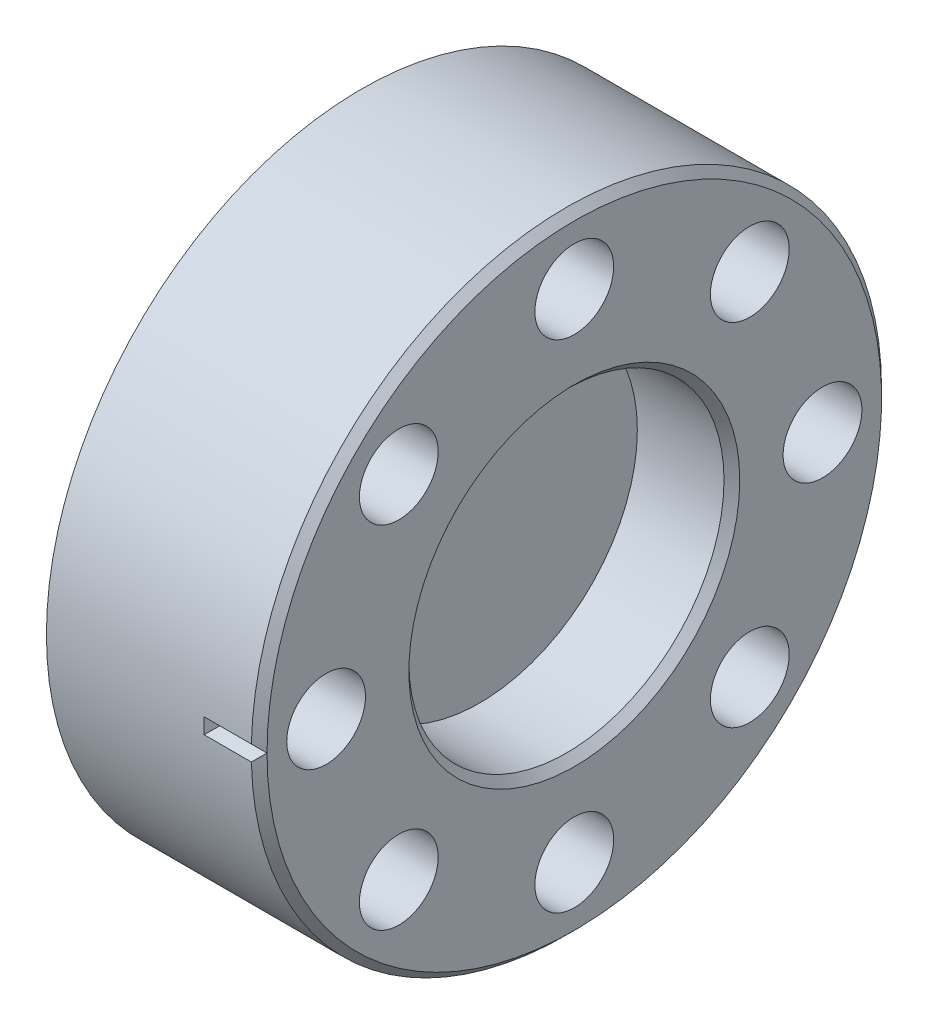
ISO-10303-21;
HEADER;
FILE_DESCRIPTION(('STEP AP214'),'2;1');
FILE_NAME('part.step','',(''),(''),'','','');
FILE_SCHEMA(('AUTOMOTIVE_DESIGN { 1 0 10303 214 1 1 1 1 }'));
ENDSEC;
DATA;
#1=APPLICATION_CONTEXT('core data for automotive mechanical design processes');
#2=APPLICATION_PROTOCOL_DEFINITION('international standard','automotive_design',2000,#1);
#3=PRODUCT_CONTEXT('',#1,'mechanical');
#4=PRODUCT('Part','Part','',(#3));
#5=PRODUCT_RELATED_PRODUCT_CATEGORY('part','',(#4));
#6=PRODUCT_DEFINITION_FORMATION('','',#4);
#7=PRODUCT_DEFINITION_CONTEXT('part definition',#1,'design');
#8=PRODUCT_DEFINITION('design','',#6,#7);
#9=PRODUCT_DEFINITION_SHAPE('','',#8);
#10=(LENGTH_UNIT() NAMED_UNIT(*) SI_UNIT(.MILLI.,.METRE.));
#11=(NAMED_UNIT(*) PLANE_ANGLE_UNIT() SI_UNIT($,.RADIAN.));
#12=(NAMED_UNIT(*) SI_UNIT($,.STERADIAN.) SOLID_ANGLE_UNIT());
#13=UNCERTAINTY_MEASURE_WITH_UNIT(LENGTH_MEASURE(1.E-05),#10,'distance_accuracy_value','');
#14=(GEOMETRIC_REPRESENTATION_CONTEXT(3) GLOBAL_UNCERTAINTY_ASSIGNED_CONTEXT((#13)) GLOBAL_UNIT_ASSIGNED_CONTEXT((#10,
#11,#12)) REPRESENTATION_CONTEXT('',''));
#15=CARTESIAN_POINT('',(0.,0.,0.));
#16=DIRECTION('',(0.,0.,1.));
#17=DIRECTION('',(1.,0.,0.));
#18=AXIS2_PLACEMENT_3D('',#15,#16,#17);
#19=CARTESIAN_POINT('',(614.,-1.9134171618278,990.380602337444));
#20=DIRECTION('',(-1.,0.,0.));
#21=DIRECTION('',(0.,0.,1.));
#22=AXIS2_PLACEMENT_3D('',#19,#20,#21);
#23=PLANE('',#22);
#24=CARTESIAN_POINT('',(614.,-2.33146835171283E-12,995.));
#25=DIRECTION('',(-1.,0.,0.));
#26=DIRECTION('',(0.,0.,1.));
#27=AXIS2_PLACEMENT_3D('',#24,#25,#26);
#28=CIRCLE('',#27,10.);
#29=CARTESIAN_POINT('',(614.,-2.33146835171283E-12,1005.));
#30=VERTEX_POINT('',#29);
#31=EDGE_CURVE('E20',#30,#30,#28,.F.);
#32=ORIENTED_EDGE('',*,*,#31,.T.);
#33=EDGE_LOOP('',(#32));
#34=FACE_BOUND('',#33,.T.);
#35=ADVANCED_FACE('F17',(#34),#23,.F.);
#36=CARTESIAN_POINT('',(612.999999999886,15.7499999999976,995.));
#37=DIRECTION('',(1.,0.,0.));
#38=DIRECTION('',(0.,0.,-1.));
#39=AXIS2_PLACEMENT_3D('',#36,#37,#38);
#40=CONICAL_SURFACE('',#39,2.4999999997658,1.02974425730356);
#41=CARTESIAN_POINT('',(611.497848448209,15.7499999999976,995.000000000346));
#42=VERTEX_POINT('',#41);
#43=VERTEX_LOOP('',#42);
#44=FACE_BOUND('',#43,.T.);
#45=CARTESIAN_POINT('',(613.,15.7499999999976,995.));
#46=DIRECTION('',(-1.,0.,0.));
#47=DIRECTION('',(0.,0.,1.));
#48=AXIS2_PLACEMENT_3D('',#45,#46,#47);
#49=CIRCLE('',#48,2.5);
#50=CARTESIAN_POINT('',(613.,15.7499999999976,997.5));
#51=VERTEX_POINT('',#50);
#52=EDGE_CURVE('E279',#51,#51,#49,.F.);
#53=ORIENTED_EDGE('',*,*,#52,.T.);
#54=EDGE_LOOP('',(#53));
#55=FACE_BOUND('',#54,.T.);
#56=ADVANCED_FACE('F171',(#44,#55),#40,.F.);
#57=CARTESIAN_POINT('',(612.999999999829,11.1369318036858,983.863068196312));
#58=DIRECTION('',(1.,0.,0.));
#59=DIRECTION('',(0.,0.,-1.));
#60=AXIS2_PLACEMENT_3D('',#57,#58,#59);
#61=CONICAL_SURFACE('',#60,2.499999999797,1.02974425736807);
#62=CARTESIAN_POINT('',(611.497848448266,11.1369318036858,983.863068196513));
#63=VERTEX_POINT('',#62);
#64=VERTEX_LOOP('',#63);
#65=FACE_BOUND('',#64,.T.);
#66=CARTESIAN_POINT('',(613.,11.1369318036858,983.863068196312));
#67=DIRECTION('',(-1.,0.,0.));
#68=DIRECTION('',(0.,0.,1.));
#69=AXIS2_PLACEMENT_3D('',#66,#67,#68);
#70=CIRCLE('',#69,2.5);
#71=CARTESIAN_POINT('',(613.,11.1369318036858,986.363068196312));
#72=VERTEX_POINT('',#71);
#73=EDGE_CURVE('E274',#72,#72,#70,.F.);
#74=ORIENTED_EDGE('',*,*,#73,.T.);
#75=EDGE_LOOP('',(#74));
#76=FACE_BOUND('',#75,.T.);
#77=ADVANCED_FACE('F168',(#65,#76),#61,.F.);
#78=CARTESIAN_POINT('',(612.999999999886,11.1369318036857,1006.13693180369));
#79=DIRECTION('',(1.,0.,0.));
#80=DIRECTION('',(0.,0.,-1.));
#81=AXIS2_PLACEMENT_3D('',#78,#79,#80);
#82=CONICAL_SURFACE('',#81,2.49999999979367,1.02974425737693);
#83=CARTESIAN_POINT('',(611.49784844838,11.1369318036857,1006.13693180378));
#84=VERTEX_POINT('',#83);
#85=VERTEX_LOOP('',#84);
#86=FACE_BOUND('',#85,.T.);
#87=CARTESIAN_POINT('',(613.,11.1369318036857,1006.13693180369));
#88=DIRECTION('',(-1.,0.,0.));
#89=DIRECTION('',(0.,0.,1.));
#90=AXIS2_PLACEMENT_3D('',#87,#88,#89);
#91=CIRCLE('',#90,2.5);
#92=CARTESIAN_POINT('',(613.,11.1369318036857,1008.63693180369));
#93=VERTEX_POINT('',#92);
#94=EDGE_CURVE('E269',#93,#93,#91,.F.);
#95=ORIENTED_EDGE('',*,*,#94,.T.);
#96=EDGE_LOOP('',(#95));
#97=FACE_BOUND('',#96,.T.);
#98=ADVANCED_FACE('F164',(#86,#97),#82,.F.);
#99=CARTESIAN_POINT('',(612.999999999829,-2.44249065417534E-12,979.25));
#100=DIRECTION('',(1.,0.,0.));
#101=DIRECTION('',(0.,0.,-1.));
#102=AXIS2_PLACEMENT_3D('',#99,#100,#101);
#103=CONICAL_SURFACE('',#102,2.49999999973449,1.02974425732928);
#104=CARTESIAN_POINT('',(611.497848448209,-2.44249065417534E-12,979.250000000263));
#105=VERTEX_POINT('',#104);
#106=VERTEX_LOOP('',#105);
#107=FACE_BOUND('',#106,.T.);
#108=CARTESIAN_POINT('',(613.,-2.44249065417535E-12,979.25));
#109=DIRECTION('',(-1.,0.,0.));
#110=DIRECTION('',(0.,0.,1.));
#111=AXIS2_PLACEMENT_3D('',#108,#109,#110);
#112=CIRCLE('',#111,2.5);
#113=CARTESIAN_POINT('',(613.,-2.44249065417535E-12,981.75));
#114=VERTEX_POINT('',#113);
#115=EDGE_CURVE('E264',#114,#114,#112,.F.);
#116=ORIENTED_EDGE('',*,*,#115,.T.);
#117=EDGE_LOOP('',(#116));
#118=FACE_BOUND('',#117,.T.);
#119=ADVANCED_FACE('F160',(#107,#118),#103,.F.);
#120=CARTESIAN_POINT('',(612.999999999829,-11.1369318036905,983.863068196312));
#121=DIRECTION('',(1.,0.,0.));
#122=DIRECTION('',(0.,0.,-1.));
#123=AXIS2_PLACEMENT_3D('',#120,#121,#122);
#124=CONICAL_SURFACE('',#123,2.499999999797,1.02974425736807);
#125=CARTESIAN_POINT('',(611.497848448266,-11.1369318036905,983.863068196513));
#126=VERTEX_POINT('',#125);
#127=VERTEX_LOOP('',#126);
#128=FACE_BOUND('',#127,.T.);
#129=CARTESIAN_POINT('',(613.,-11.1369318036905,983.863068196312));
#130=DIRECTION('',(-1.,0.,0.));
#131=DIRECTION('',(0.,0.,1.));
#132=AXIS2_PLACEMENT_3D('',#129,#130,#131);
#133=CIRCLE('',#132,2.5);
#134=CARTESIAN_POINT('',(613.,-11.1369318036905,986.363068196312));
#135=VERTEX_POINT('',#134);
#136=EDGE_CURVE('E259',#135,#135,#133,.F.);
#137=ORIENTED_EDGE('',*,*,#136,.T.);
#138=EDGE_LOOP('',(#137));
#139=FACE_BOUND('',#138,.T.);
#140=ADVANCED_FACE('F156',(#128,#139),#124,.F.);
#141=CARTESIAN_POINT('',(612.999999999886,-15.7500000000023,995.));
#142=DIRECTION('',(1.,0.,0.));
#143=DIRECTION('',(0.,0.,-1.));
#144=AXIS2_PLACEMENT_3D('',#141,#142,#143);
#145=CONICAL_SURFACE('',#144,2.4999999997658,1.02974425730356);
#146=CARTESIAN_POINT('',(611.497848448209,-15.7500000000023,995.000000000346));
#147=VERTEX_POINT('',#146);
#148=VERTEX_LOOP('',#147);
#149=FACE_BOUND('',#148,.T.);
#150=CARTESIAN_POINT('',(613.,-15.7500000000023,995.));
#151=DIRECTION('',(-1.,0.,0.));
#152=DIRECTION('',(0.,0.,1.));
#153=AXIS2_PLACEMENT_3D('',#150,#151,#152);
#154=CIRCLE('',#153,2.5);
#155=CARTESIAN_POINT('',(613.,-15.7500000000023,997.5));
#156=VERTEX_POINT('',#155);
#157=EDGE_CURVE('E254',#156,#156,#154,.F.);
#158=ORIENTED_EDGE('',*,*,#157,.T.);
#159=EDGE_LOOP('',(#158));
#160=FACE_BOUND('',#159,.T.);
#161=ADVANCED_FACE('F152',(#149,#160),#145,.F.);
#162=CARTESIAN_POINT('',(612.999999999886,-11.1369318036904,1006.13693180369));
#163=DIRECTION('',(1.,0.,0.));
#164=DIRECTION('',(0.,0.,-1.));
#165=AXIS2_PLACEMENT_3D('',#162,#163,#164);
#166=CONICAL_SURFACE('',#165,2.49999999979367,1.02974425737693);
#167=CARTESIAN_POINT('',(611.49784844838,-11.1369318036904,1006.13693180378));
#168=VERTEX_POINT('',#167);
#169=VERTEX_LOOP('',#168);
#170=FACE_BOUND('',#169,.T.);
#171=CARTESIAN_POINT('',(613.,-11.1369318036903,1006.13693180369));
#172=DIRECTION('',(-1.,0.,0.));
#173=DIRECTION('',(0.,0.,1.));
#174=AXIS2_PLACEMENT_3D('',#171,#172,#173);
#175=CIRCLE('',#174,2.5);
#176=CARTESIAN_POINT('',(613.,-11.1369318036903,1008.63693180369));
#177=VERTEX_POINT('',#176);
#178=EDGE_CURVE('E245',#177,#177,#175,.F.);
#179=ORIENTED_EDGE('',*,*,#178,.T.);
#180=EDGE_LOOP('',(#179));
#181=FACE_BOUND('',#180,.T.);
#182=ADVANCED_FACE('F148',(#170,#181),#166,.F.);
#183=CARTESIAN_POINT('',(606.8,-2.33146835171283E-12,995.));
#184=DIRECTION('',(-1.,0.,0.));
#185=DIRECTION('',(0.,0.,1.));
#186=AXIS2_PLACEMENT_3D('',#183,#184,#185);
#187=CYLINDRICAL_SURFACE('',#186,10.);
#188=ORIENTED_EDGE('',*,*,#31,.F.);
#189=EDGE_LOOP('',(#188));
#190=FACE_BOUND('',#189,.T.);
#191=CARTESIAN_POINT('',(619.499999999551,-2.33146835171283E-12,995.));
#192=DIRECTION('',(1.,0.,0.));
#193=DIRECTION('',(0.,0.923879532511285,-0.382683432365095));
#194=AXIS2_PLACEMENT_3D('',#191,#192,#193);
#195=CIRCLE('',#194,10.0000000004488);
#196=CARTESIAN_POINT('',(619.499999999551,9.23879532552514,991.173165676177));
#197=VERTEX_POINT('',#196);
#198=EDGE_CURVE('E241',#197,#197,#195,.T.);
#199=ORIENTED_EDGE('',*,*,#198,.T.);
#200=EDGE_LOOP('',(#199));
#201=FACE_BOUND('',#200,.T.);
#202=ADVANCED_FACE('F144',(#190,#201),#187,.F.);
#203=CARTESIAN_POINT('',(614.999999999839,-2.33146835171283E-12,1010.75));
#204=DIRECTION('',(1.,0.,0.));
#205=DIRECTION('',(0.,0.,-1.));
#206=AXIS2_PLACEMENT_3D('',#203,#204,#205);
#207=CONICAL_SURFACE('',#206,2.49999999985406,1.02974425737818);
#208=CARTESIAN_POINT('',(613.497848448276,-2.33146835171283E-12,1010.75000000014));
#209=VERTEX_POINT('',#208);
#210=VERTEX_LOOP('',#209);
#211=FACE_BOUND('',#210,.T.);
#212=CARTESIAN_POINT('',(615.,-2.33146835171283E-12,1010.75));
#213=DIRECTION('',(-1.,0.,0.));
#214=DIRECTION('',(0.,0.,1.));
#215=AXIS2_PLACEMENT_3D('',#212,#213,#214);
#216=CIRCLE('',#215,2.5);
#217=CARTESIAN_POINT('',(615.,-2.33146835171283E-12,1013.25));
#218=VERTEX_POINT('',#217);
#219=EDGE_CURVE('E238',#218,#218,#216,.F.);
#220=ORIENTED_EDGE('',*,*,#219,.T.);
#221=EDGE_LOOP('',(#220));
#222=FACE_BOUND('',#221,.T.);
#223=ADVANCED_FACE('F140',(#211,#222),#207,.F.);
#224=CARTESIAN_POINT('',(620.,15.7499999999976,995.));
#225=DIRECTION('',(-1.,0.,0.));
#226=DIRECTION('',(0.,0.,1.));
#227=AXIS2_PLACEMENT_3D('',#224,#225,#226);
#228=CYLINDRICAL_SURFACE('',#227,2.5);
#229=CARTESIAN_POINT('',(620.,15.7499999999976,995.));
#230=DIRECTION('',(-1.,0.,0.));
#231=DIRECTION('',(0.,0.,1.));
#232=AXIS2_PLACEMENT_3D('',#229,#230,#231);
#233=CIRCLE('',#232,2.5);
#234=CARTESIAN_POINT('',(620.,15.7499999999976,997.5));
#235=VERTEX_POINT('',#234);
#236=EDGE_CURVE('E236',#235,#235,#233,.F.);
#237=ORIENTED_EDGE('',*,*,#236,.T.);
#238=EDGE_LOOP('',(#237));
#239=FACE_BOUND('',#238,.T.);
#240=ORIENTED_EDGE('',*,*,#52,.F.);
#241=EDGE_LOOP('',(#240));
#242=FACE_BOUND('',#241,.T.);
#243=ADVANCED_FACE('F136',(#239,#242),#228,.F.);
#244=CARTESIAN_POINT('',(620.,11.1369318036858,983.863068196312));
#245=DIRECTION('',(-1.,0.,0.));
#246=DIRECTION('',(0.,0.,1.));
#247=AXIS2_PLACEMENT_3D('',#244,#245,#246);
#248=CYLINDRICAL_SURFACE('',#247,2.5);
#249=CARTESIAN_POINT('',(620.,11.1369318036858,983.863068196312));
#250=DIRECTION('',(-1.,0.,0.));
#251=DIRECTION('',(0.,0.,1.));
#252=AXIS2_PLACEMENT_3D('',#249,#250,#251);
#253=CIRCLE('',#252,2.5);
#254=CARTESIAN_POINT('',(620.,11.1369318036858,986.363068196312));
#255=VERTEX_POINT('',#254);
#256=EDGE_CURVE('E234',#255,#255,#253,.F.);
#257=ORIENTED_EDGE('',*,*,#256,.T.);
#258=EDGE_LOOP('',(#257));
#259=FACE_BOUND('',#258,.T.);
#260=ORIENTED_EDGE('',*,*,#73,.F.);
#261=EDGE_LOOP('',(#260));
#262=FACE_BOUND('',#261,.T.);
#263=ADVANCED_FACE('F132',(#259,#262),#248,.F.);
#264=CARTESIAN_POINT('',(620.,11.1369318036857,1006.13693180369));
#265=DIRECTION('',(-1.,0.,0.));
#266=DIRECTION('',(0.,0.,1.));
#267=AXIS2_PLACEMENT_3D('',#264,#265,#266);
#268=CYLINDRICAL_SURFACE('',#267,2.5);
#269=CARTESIAN_POINT('',(620.,11.1369318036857,1006.13693180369));
#270=DIRECTION('',(-1.,0.,0.));
#271=DIRECTION('',(0.,0.,1.));
#272=AXIS2_PLACEMENT_3D('',#269,#270,#271);
#273=CIRCLE('',#272,2.5);
#274=CARTESIAN_POINT('',(620.,11.1369318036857,1008.63693180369));
#275=VERTEX_POINT('',#274);
#276=EDGE_CURVE('E231',#275,#275,#273,.F.);
#277=ORIENTED_EDGE('',*,*,#276,.T.);
#278=EDGE_LOOP('',(#277));
#279=FACE_BOUND('',#278,.T.);
#280=ORIENTED_EDGE('',*,*,#94,.F.);
#281=EDGE_LOOP('',(#280));
#282=FACE_BOUND('',#281,.T.);
#283=ADVANCED_FACE('F128',(#279,#282),#268,.F.);
#284=CARTESIAN_POINT('',(620.,-2.44249065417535E-12,979.25));
#285=DIRECTION('',(-1.,0.,0.));
#286=DIRECTION('',(0.,0.,1.));
#287=AXIS2_PLACEMENT_3D('',#284,#285,#286);
#288=CYLINDRICAL_SURFACE('',#287,2.5);
#289=CARTESIAN_POINT('',(620.,-2.44249065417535E-12,979.25));
#290=DIRECTION('',(-1.,0.,0.));
#291=DIRECTION('',(0.,0.,1.));
#292=AXIS2_PLACEMENT_3D('',#289,#290,#291);
#293=CIRCLE('',#292,2.5);
#294=CARTESIAN_POINT('',(620.,-2.44249065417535E-12,981.75));
#295=VERTEX_POINT('',#294);
#296=EDGE_CURVE('E228',#295,#295,#293,.F.);
#297=ORIENTED_EDGE('',*,*,#296,.T.);
#298=EDGE_LOOP('',(#297));
#299=FACE_BOUND('',#298,.T.);
#300=ORIENTED_EDGE('',*,*,#115,.F.);
#301=EDGE_LOOP('',(#300));
#302=FACE_BOUND('',#301,.T.);
#303=ADVANCED_FACE('F124',(#299,#302),#288,.F.);
#304=CARTESIAN_POINT('',(620.,-11.1369318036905,983.863068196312));
#305=DIRECTION('',(-1.,0.,0.));
#306=DIRECTION('',(0.,0.,1.));
#307=AXIS2_PLACEMENT_3D('',#304,#305,#306);
#308=CYLINDRICAL_SURFACE('',#307,2.5);
#309=CARTESIAN_POINT('',(620.,-11.1369318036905,983.863068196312));
#310=DIRECTION('',(-1.,0.,0.));
#311=DIRECTION('',(0.,0.,1.));
#312=AXIS2_PLACEMENT_3D('',#309,#310,#311);
#313=CIRCLE('',#312,2.5);
#314=CARTESIAN_POINT('',(620.,-11.1369318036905,986.363068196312));
#315=VERTEX_POINT('',#314);
#316=EDGE_CURVE('E225',#315,#315,#313,.F.);
#317=ORIENTED_EDGE('',*,*,#316,.T.);
#318=EDGE_LOOP('',(#317));
#319=FACE_BOUND('',#318,.T.);
#320=ORIENTED_EDGE('',*,*,#136,.F.);
#321=EDGE_LOOP('',(#320));
#322=FACE_BOUND('',#321,.T.);
#323=ADVANCED_FACE('F120',(#319,#322),#308,.F.);
#324=CARTESIAN_POINT('',(620.,-15.7500000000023,995.));
#325=DIRECTION('',(-1.,0.,0.));
#326=DIRECTION('',(0.,0.,1.));
#327=AXIS2_PLACEMENT_3D('',#324,#325,#326);
#328=CYLINDRICAL_SURFACE('',#327,2.5);
#329=CARTESIAN_POINT('',(620.,-15.7500000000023,995.));
#330=DIRECTION('',(-1.,0.,0.));
#331=DIRECTION('',(0.,0.,1.));
#332=AXIS2_PLACEMENT_3D('',#329,#330,#331);
#333=CIRCLE('',#332,2.5);
#334=CARTESIAN_POINT('',(620.,-15.7500000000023,997.5));
#335=VERTEX_POINT('',#334);
#336=EDGE_CURVE('E222',#335,#335,#333,.F.);
#337=ORIENTED_EDGE('',*,*,#336,.T.);
#338=EDGE_LOOP('',(#337));
#339=FACE_BOUND('',#338,.T.);
#340=ORIENTED_EDGE('',*,*,#157,.F.);
#341=EDGE_LOOP('',(#340));
#342=FACE_BOUND('',#341,.T.);
#343=ADVANCED_FACE('F116',(#339,#342),#328,.F.);
#344=CARTESIAN_POINT('',(620.,-11.1369318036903,1006.13693180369));
#345=DIRECTION('',(-1.,0.,0.));
#346=DIRECTION('',(0.,0.,1.));
#347=AXIS2_PLACEMENT_3D('',#344,#345,#346);
#348=CYLINDRICAL_SURFACE('',#347,2.5);
#349=CARTESIAN_POINT('',(620.,-11.1369318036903,1006.13693180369));
#350=DIRECTION('',(-1.,0.,0.));
#351=DIRECTION('',(0.,0.,1.));
#352=AXIS2_PLACEMENT_3D('',#349,#350,#351);
#353=CIRCLE('',#352,2.5);
#354=CARTESIAN_POINT('',(620.,-11.1369318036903,1008.63693180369));
#355=VERTEX_POINT('',#354);
#356=EDGE_CURVE('E219',#355,#355,#353,.F.);
#357=ORIENTED_EDGE('',*,*,#356,.T.);
#358=EDGE_LOOP('',(#357));
#359=FACE_BOUND('',#358,.T.);
#360=ORIENTED_EDGE('',*,*,#178,.F.);
#361=EDGE_LOOP('',(#360));
#362=FACE_BOUND('',#361,.T.);
#363=ADVANCED_FACE('F112',(#359,#362),#348,.F.);
#364=CARTESIAN_POINT('',(620.,-2.33146835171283E-12,995.));
#365=DIRECTION('',(1.,0.,0.));
#366=DIRECTION('',(0.,0.,-1.));
#367=AXIS2_PLACEMENT_3D('',#364,#365,#366);
#368=CONICAL_SURFACE('',#367,10.4999999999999,0.785398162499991);
#369=CARTESIAN_POINT('',(620.,-2.33146835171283E-12,995.));
#370=DIRECTION('',(1.,0.,0.));
#371=DIRECTION('',(0.,0.,-1.));
#372=AXIS2_PLACEMENT_3D('',#369,#370,#371);
#373=CIRCLE('',#372,10.4999999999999);
#374=CARTESIAN_POINT('',(620.,-2.33146835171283E-12,984.5));
#375=VERTEX_POINT('',#374);
#376=EDGE_CURVE('E216',#375,#375,#373,.T.);
#377=ORIENTED_EDGE('',*,*,#376,.T.);
#378=EDGE_LOOP('',(#377));
#379=FACE_BOUND('',#378,.T.);
#380=ORIENTED_EDGE('',*,*,#198,.F.);
#381=EDGE_LOOP('',(#380));
#382=FACE_BOUND('',#381,.T.);
#383=ADVANCED_FACE('F108',(#379,#382),#368,.F.);
#384=CARTESIAN_POINT('',(620.,-2.33146835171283E-12,1010.75));
#385=DIRECTION('',(-1.,0.,0.));
#386=DIRECTION('',(0.,0.,1.));
#387=AXIS2_PLACEMENT_3D('',#384,#385,#386);
#388=CYLINDRICAL_SURFACE('',#387,2.5);
#389=CARTESIAN_POINT('',(620.,-2.33146835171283E-12,1010.75));
#390=DIRECTION('',(-1.,0.,0.));
#391=DIRECTION('',(0.,0.,1.));
#392=AXIS2_PLACEMENT_3D('',#389,#390,#391);
#393=CIRCLE('',#392,2.5);
#394=CARTESIAN_POINT('',(620.,-2.33146835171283E-12,1013.25));
#395=VERTEX_POINT('',#394);
#396=EDGE_CURVE('E64',#395,#395,#393,.F.);
#397=ORIENTED_EDGE('',*,*,#396,.T.);
#398=EDGE_LOOP('',(#397));
#399=FACE_BOUND('',#398,.T.);
#400=ORIENTED_EDGE('',*,*,#219,.F.);
#401=EDGE_LOOP('',(#400));
#402=FACE_BOUND('',#401,.T.);
#403=ADVANCED_FACE('F104',(#399,#402),#388,.F.);
#404=CARTESIAN_POINT('',(620.,-3.82683432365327,985.761204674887));
#405=DIRECTION('',(-1.,0.,0.));
#406=DIRECTION('',(0.,0.,1.));
#407=AXIS2_PLACEMENT_3D('',#404,#405,#406);
#408=PLANE('',#407);
#409=ORIENTED_EDGE('',*,*,#396,.F.);
#410=EDGE_LOOP('',(#409));
#411=FACE_BOUND('',#410,.T.);
#412=CARTESIAN_POINT('',(620.000000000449,-2.33093727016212E-12,995.));
#413=DIRECTION('',(-1.,0.,0.));
#414=DIRECTION('',(0.,0.,1.));
#415=AXIS2_PLACEMENT_3D('',#412,#413,#414);
#416=CIRCLE('',#415,19.4999396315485);
#417=CARTESIAN_POINT('',(620.000000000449,-2.33093727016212E-12,1014.49993963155));
#418=VERTEX_POINT('',#417);
#419=EDGE_CURVE('E63',#418,#418,#416,.T.);
#420=ORIENTED_EDGE('',*,*,#419,.F.);
#421=EDGE_LOOP('',(#420));
#422=FACE_BOUND('',#421,.T.);
#423=ORIENTED_EDGE('',*,*,#376,.F.);
#424=EDGE_LOOP('',(#423));
#425=FACE_BOUND('',#424,.T.);
#426=ORIENTED_EDGE('',*,*,#356,.F.);
#427=EDGE_LOOP('',(#426));
#428=FACE_BOUND('',#427,.T.);
#429=ORIENTED_EDGE('',*,*,#336,.F.);
#430=EDGE_LOOP('',(#429));
#431=FACE_BOUND('',#430,.T.);
#432=ORIENTED_EDGE('',*,*,#316,.F.);
#433=EDGE_LOOP('',(#432));
#434=FACE_BOUND('',#433,.T.);
#435=ORIENTED_EDGE('',*,*,#296,.F.);
#436=EDGE_LOOP('',(#435));
#437=FACE_BOUND('',#436,.T.);
#438=ORIENTED_EDGE('',*,*,#276,.F.);
#439=EDGE_LOOP('',(#438));
#440=FACE_BOUND('',#439,.T.);
#441=ORIENTED_EDGE('',*,*,#256,.F.);
#442=EDGE_LOOP('',(#441));
#443=FACE_BOUND('',#442,.T.);
#444=ORIENTED_EDGE('',*,*,#236,.F.);
#445=EDGE_LOOP('',(#444));
#446=FACE_BOUND('',#445,.T.);
#447=ADVANCED_FACE('F101',(#411,#422,#425,#428,#431,#434,#437,#440,#443,#446),#408,.F.);
#448=CARTESIAN_POINT('',(616.499999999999,-2.33146835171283E-12,995.));
#449=DIRECTION('',(-1.,0.,0.));
#450=DIRECTION('',(0.,0.,1.));
#451=AXIS2_PLACEMENT_3D('',#448,#449,#450);
#452=CONICAL_SURFACE('',#451,19.9999396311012,0.785398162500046);
#453=CARTESIAN_POINT('',(616.9999396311,-2.17317483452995E-12,1014.5));
#454=CARTESIAN_POINT('',(616.756143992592,-0.243795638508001,1014.74379563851));
#455=CARTESIAN_POINT('',(616.5,-0.493841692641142,1014.99384169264));
#456=B_SPLINE_CURVE_WITH_KNOTS('',2,(#453,#454,#455),.UNSPECIFIED.,.F.,.F.,(3,3),(0.,1.),.UNSPECIFIED.);
#457=CARTESIAN_POINT('',(616.9999396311,-2.25232159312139E-12,1014.5));
#458=VERTEX_POINT('',#457);
#459=CARTESIAN_POINT('',(616.5,-0.493841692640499,1014.99384169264));
#460=VERTEX_POINT('',#459);
#461=EDGE_CURVE('E66',#458,#460,#456,.T.);
#462=ORIENTED_EDGE('',*,*,#461,.F.);
#463=CARTESIAN_POINT('',(616.5,0.493841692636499,1014.99384169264));
#464=CARTESIAN_POINT('',(616.756143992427,0.243795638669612,1014.74379563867));
#465=CARTESIAN_POINT('',(616.9999396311,-2.33146835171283E-12,1014.5));
#466=B_SPLINE_CURVE_WITH_KNOTS('',2,(#463,#464,#465),.UNSPECIFIED.,.F.,.F.,(3,3),(0.,1.),.UNSPECIFIED.);
#467=CARTESIAN_POINT('',(616.5,0.493841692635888,1014.99384169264));
#468=VERTEX_POINT('',#467);
#469=EDGE_CURVE('E51',#468,#458,#466,.T.);
#470=ORIENTED_EDGE('',*,*,#469,.F.);
#471=CARTESIAN_POINT('',(616.5,-2.33146835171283E-12,995.));
#472=DIRECTION('',(-1.,0.,0.));
#473=DIRECTION('',(0.,0.,1.));
#474=AXIS2_PLACEMENT_3D('',#471,#472,#473);
#475=CIRCLE('',#474,19.9999396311);
#476=EDGE_CURVE('E54',#460,#468,#475,.T.);
#477=ORIENTED_EDGE('',*,*,#476,.F.);
#478=EDGE_LOOP('',(#462,#470,#477));
#479=FACE_BOUND('',#478,.T.);
#480=ADVANCED_FACE('F67',(#479),#452,.T.);
#481=CARTESIAN_POINT('',(622.8,-2.33146835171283E-12,1014.5));
#482=DIRECTION('',(0.,-0.707106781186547,0.707106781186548));
#483=DIRECTION('',(0.,-0.707106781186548,-0.707106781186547));
#484=AXIS2_PLACEMENT_3D('',#481,#482,#483);
#485=PLANE('',#484);
#486=DIRECTION('',(1.,0.,0.));
#487=VECTOR('',#486,1.);
#488=CARTESIAN_POINT('',(622.8,-2.17317483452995E-12,1014.5));
#489=LINE('',#488,#487);
#490=CARTESIAN_POINT('',(619.999939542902,-2.25205608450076E-12,1014.50000008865));
#491=VERTEX_POINT('',#490);
#492=EDGE_CURVE('E60',#491,#458,#489,.F.);
#493=ORIENTED_EDGE('',*,*,#492,.F.);
#494=CARTESIAN_POINT('',(619.499999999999,0.493841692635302,1014.99384169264));
#495=CARTESIAN_POINT('',(619.521251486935,0.473096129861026,1014.97309613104));
#496=CARTESIAN_POINT('',(619.542482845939,0.452340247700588,1014.95234026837));
#497=CARTESIAN_POINT('',(619.58483100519,0.410879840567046,1014.91087991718));
#498=CARTESIAN_POINT('',(619.605947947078,0.39017538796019,1014.89017550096));
#499=CARTESIAN_POINT('',(619.648067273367,0.348817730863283,1014.84881791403));
#500=CARTESIAN_POINT('',(619.669069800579,0.328164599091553,1014.82816481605));
#501=CARTESIAN_POINT('',(619.710960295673,0.286909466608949,1014.78690973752));
#502=CARTESIAN_POINT('',(619.731848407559,0.266307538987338,1014.76630783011));
#503=CARTESIAN_POINT('',(619.773510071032,0.225154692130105,1014.72515500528));
#504=CARTESIAN_POINT('',(619.794283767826,0.204603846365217,1014.70460416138));
#505=CARTESIAN_POINT('',(619.835716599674,0.163553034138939,1014.66355333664));
#506=CARTESIAN_POINT('',(619.856375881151,0.143053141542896,1014.6430534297));
#507=CARTESIAN_POINT('',(619.897579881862,0.102104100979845,1014.6021043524));
#508=CARTESIAN_POINT('',(619.918124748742,0.0816550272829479,1014.58165525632));
#509=CARTESIAN_POINT('',(619.959099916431,0.0408074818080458,1014.54080767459));
#510=CARTESIAN_POINT('',(619.979530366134,0.0204090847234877,1014.52040926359));
#511=CARTESIAN_POINT('',(619.999939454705,-2.33093733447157E-12,1014.50000017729));
#512=B_SPLINE_CURVE_WITH_KNOTS('',3,(#494,#495,#496,#497,#498,#499,#500,#501,#502,#503,#504,
#505,#506,#507,#508,#509,#510,#511),.UNSPECIFIED.,.F.,.F.,(4,2,2,2,2,2,2,2,4),(0.,
0.108680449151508,0.216983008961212,0.324908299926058,0.432456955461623,0.539629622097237,
0.646426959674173,0.752849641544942,0.858898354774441),.UNSPECIFIED.);
#513=CARTESIAN_POINT('',(619.5,0.493841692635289,1014.99384169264));
#514=VERTEX_POINT('',#513);
#515=EDGE_CURVE('E73',#514,#491,#512,.T.);
#516=ORIENTED_EDGE('',*,*,#515,.F.);
#517=DIRECTION('',(-1.,0.,0.));
#518=VECTOR('',#517,1.);
#519=CARTESIAN_POINT('',(606.8,0.493841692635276,1014.99384169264));
#520=LINE('',#519,#518);
#521=EDGE_CURVE('E62',#468,#514,#520,.F.);
#522=ORIENTED_EDGE('',*,*,#521,.F.);
#523=ORIENTED_EDGE('',*,*,#469,.T.);
#524=EDGE_LOOP('',(#493,#516,#522,#523));
#525=FACE_BOUND('',#524,.T.);
#526=ADVANCED_FACE('F58',(#525),#485,.T.);
#527=CARTESIAN_POINT('',(619.499999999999,-2.33146835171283E-12,995.));
#528=DIRECTION('',(-1.,0.,0.));
#529=DIRECTION('',(0.,0.,1.));
#530=AXIS2_PLACEMENT_3D('',#527,#528,#529);
#531=CONICAL_SURFACE('',#530,19.9999396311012,0.785398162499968);
#532=ORIENTED_EDGE('',*,*,#515,.T.);
#533=CARTESIAN_POINT('',(619.5,-0.493841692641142,1014.99384169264));
#534=CARTESIAN_POINT('',(619.756143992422,-0.243795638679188,1014.74379563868));
#535=CARTESIAN_POINT('',(619.9999396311,-2.17317483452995E-12,1014.5));
#536=B_SPLINE_CURVE_WITH_KNOTS('',2,(#533,#534,#535),.UNSPECIFIED.,.F.,.F.,(3,3),(0.,1.),.UNSPECIFIED.);
#537=CARTESIAN_POINT('',(619.5,-0.493841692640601,1014.99384169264));
#538=VERTEX_POINT('',#537);
#539=EDGE_CURVE('E35',#538,#491,#536,.T.);
#540=ORIENTED_EDGE('',*,*,#539,.F.);
#541=CARTESIAN_POINT('',(619.5,-2.33146835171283E-12,995.));
#542=DIRECTION('',(-1.,0.,0.));
#543=DIRECTION('',(0.,0.,1.));
#544=AXIS2_PLACEMENT_3D('',#541,#542,#543);
#545=CIRCLE('',#544,19.9999396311);
#546=EDGE_CURVE('E78',#514,#538,#545,.T.);
#547=ORIENTED_EDGE('',*,*,#546,.F.);
#548=EDGE_LOOP('',(#532,#540,#547));
#549=FACE_BOUND('',#548,.T.);
#550=ORIENTED_EDGE('',*,*,#419,.T.);
#551=EDGE_LOOP('',(#550));
#552=FACE_BOUND('',#551,.T.);
#553=ADVANCED_FACE('F97',(#549,#552),#531,.T.);
#554=CARTESIAN_POINT('',(622.8,-3.00000000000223,1017.5));
#555=DIRECTION('',(0.,0.707106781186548,0.707106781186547));
#556=DIRECTION('',(0.,-0.707106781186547,0.707106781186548));
#557=AXIS2_PLACEMENT_3D('',#554,#555,#556);
#558=PLANE('',#557);
#559=ORIENTED_EDGE('',*,*,#492,.T.);
#560=ORIENTED_EDGE('',*,*,#461,.T.);
#561=DIRECTION('',(-1.,0.,0.));
#562=VECTOR('',#561,1.);
#563=CARTESIAN_POINT('',(606.8,-0.49384169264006,1014.99384169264));
#564=LINE('',#563,#562);
#565=EDGE_CURVE('E26',#538,#460,#564,.T.);
#566=ORIENTED_EDGE('',*,*,#565,.F.);
#567=ORIENTED_EDGE('',*,*,#539,.T.);
#568=EDGE_LOOP('',(#559,#560,#566,#567));
#569=FACE_BOUND('',#568,.T.);
#570=ADVANCED_FACE('F71',(#569),#558,.T.);
#571=CARTESIAN_POINT('',(606.5,-2.33146835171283E-12,995.));
#572=DIRECTION('',(-1.,0.,0.));
#573=DIRECTION('',(0.,0.,1.));
#574=AXIS2_PLACEMENT_3D('',#571,#572,#573);
#575=PLANE('',#574);
#576=CARTESIAN_POINT('',(606.5,-2.33146835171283E-12,995.));
#577=DIRECTION('',(-1.,0.,0.));
#578=DIRECTION('',(0.,0.,1.));
#579=AXIS2_PLACEMENT_3D('',#576,#577,#578);
#580=CIRCLE('',#579,19.9999396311);
#581=CARTESIAN_POINT('',(606.5,-2.33146835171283E-12,1014.9999396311));
#582=VERTEX_POINT('',#581);
#583=EDGE_CURVE('E11',#582,#582,#580,.F.);
#584=ORIENTED_EDGE('',*,*,#583,.F.);
#585=EDGE_LOOP('',(#584));
#586=FACE_BOUND('',#585,.T.);
#587=ADVANCED_FACE('F184',(#586),#575,.T.);
#588=CARTESIAN_POINT('',(606.8,-2.33146835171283E-12,995.));
#589=DIRECTION('',(-1.,0.,0.));
#590=DIRECTION('',(0.,0.,1.));
#591=AXIS2_PLACEMENT_3D('',#588,#589,#590);
#592=CYLINDRICAL_SURFACE('',#591,19.9999396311);
#593=ORIENTED_EDGE('',*,*,#583,.T.);
#594=EDGE_LOOP('',(#593));
#595=FACE_BOUND('',#594,.T.);
#596=ORIENTED_EDGE('',*,*,#546,.T.);
#597=ORIENTED_EDGE('',*,*,#565,.T.);
#598=ORIENTED_EDGE('',*,*,#476,.T.);
#599=ORIENTED_EDGE('',*,*,#521,.T.);
#600=EDGE_LOOP('',(#596,#597,#598,#599));
#601=FACE_BOUND('',#600,.T.);
#602=ADVANCED_FACE('F182',(#595,#601),#592,.T.);
#603=CLOSED_SHELL('',(#35,#56,#77,#98,#119,#140,#161,#182,#202,#223,#243,#263,#283,#303,#323,
#343,#363,#383,#403,#447,#480,#526,#553,#570,#587,#602));
#604=MANIFOLD_SOLID_BREP('B1',#603);
#605=ADVANCED_BREP_SHAPE_REPRESENTATION('',(#18,#604),#14);
#606=SHAPE_DEFINITION_REPRESENTATION(#9,#605);
ENDSEC;
END-ISO-10303-21;
